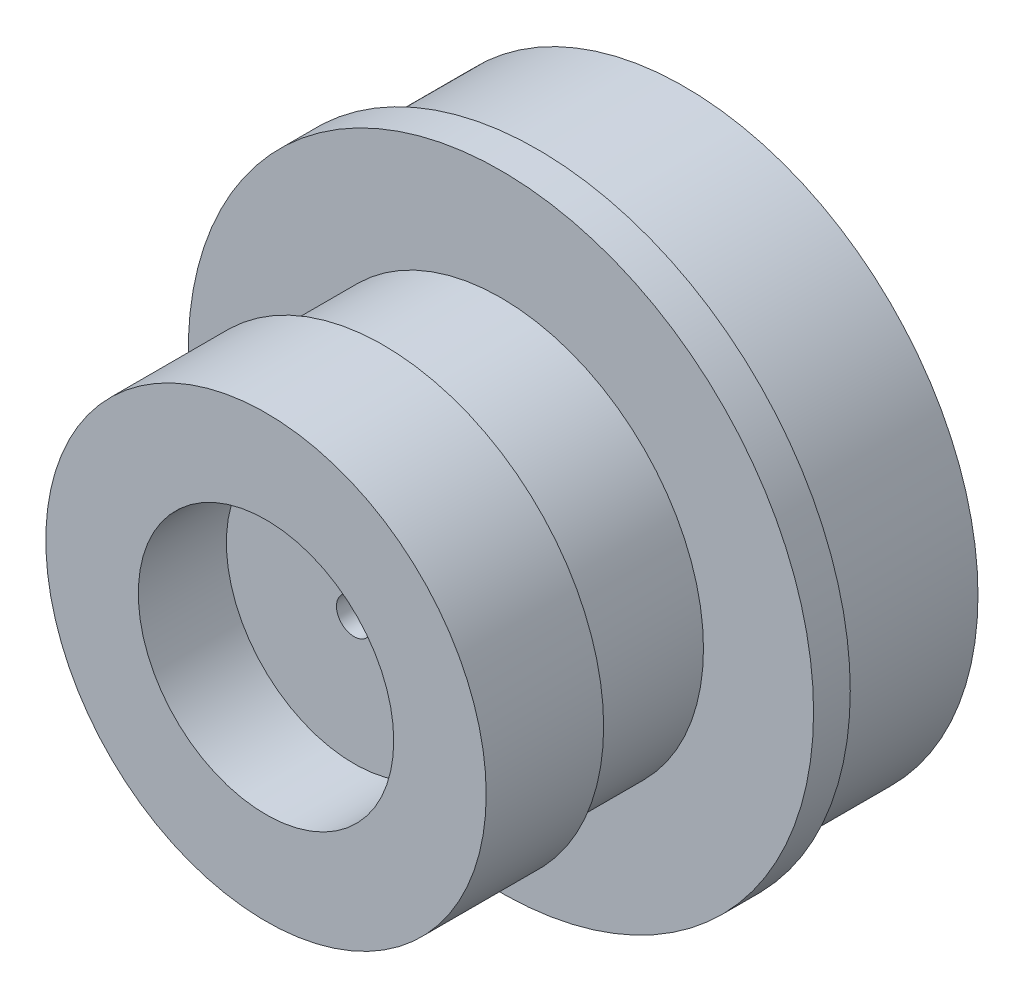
ISO-10303-21;
HEADER;
FILE_DESCRIPTION(('STEP AP214'),'2;1');
FILE_NAME('part.step','',(''),(''),'','','');
FILE_SCHEMA(('AUTOMOTIVE_DESIGN { 1 0 10303 214 1 1 1 1 }'));
ENDSEC;
DATA;
#1=APPLICATION_CONTEXT('core data for automotive mechanical design processes');
#2=APPLICATION_PROTOCOL_DEFINITION('international standard','automotive_design',2000,#1);
#3=PRODUCT_CONTEXT('',#1,'mechanical');
#4=PRODUCT('Part','Part','',(#3));
#5=PRODUCT_RELATED_PRODUCT_CATEGORY('part','',(#4));
#6=PRODUCT_DEFINITION_FORMATION('','',#4);
#7=PRODUCT_DEFINITION_CONTEXT('part definition',#1,'design');
#8=PRODUCT_DEFINITION('design','',#6,#7);
#9=PRODUCT_DEFINITION_SHAPE('','',#8);
#10=(LENGTH_UNIT() NAMED_UNIT(*) SI_UNIT(.MILLI.,.METRE.));
#11=(NAMED_UNIT(*) PLANE_ANGLE_UNIT() SI_UNIT($,.RADIAN.));
#12=(NAMED_UNIT(*) SI_UNIT($,.STERADIAN.) SOLID_ANGLE_UNIT());
#13=UNCERTAINTY_MEASURE_WITH_UNIT(LENGTH_MEASURE(1.E-05),#10,'distance_accuracy_value','');
#14=(GEOMETRIC_REPRESENTATION_CONTEXT(3) GLOBAL_UNCERTAINTY_ASSIGNED_CONTEXT((#13)) GLOBAL_UNIT_ASSIGNED_CONTEXT((#10,
#11,#12)) REPRESENTATION_CONTEXT('',''));
#15=CARTESIAN_POINT('',(0.,0.,0.));
#16=DIRECTION('',(0.,0.,1.));
#17=DIRECTION('',(1.,0.,0.));
#18=AXIS2_PLACEMENT_3D('',#15,#16,#17);
#19=CARTESIAN_POINT('',(0.,0.,0.));
#20=DIRECTION('',(0.,0.,1.));
#21=DIRECTION('',(1.,0.,0.));
#22=AXIS2_PLACEMENT_3D('',#19,#20,#21);
#23=CYLINDRICAL_SURFACE('',#22,1.524);
#24=CARTESIAN_POINT('',(0.,0.,28.575));
#25=DIRECTION('',(0.,0.,1.));
#26=DIRECTION('',(1.,0.,0.));
#27=AXIS2_PLACEMENT_3D('',#24,#25,#26);
#28=CIRCLE('',#27,1.524);
#29=CARTESIAN_POINT('',(1.524,0.,28.575));
#30=VERTEX_POINT('',#29);
#31=EDGE_CURVE('E66',#30,#30,#28,.T.);
#32=ORIENTED_EDGE('',*,*,#31,.T.);
#33=EDGE_LOOP('',(#32));
#34=FACE_BOUND('',#33,.T.);
#35=CARTESIAN_POINT('',(0.,0.,25.4));
#36=DIRECTION('',(0.,0.,-1.));
#37=DIRECTION('',(-1.,0.,0.));
#38=AXIS2_PLACEMENT_3D('',#35,#36,#37);
#39=CIRCLE('',#38,1.524);
#40=CARTESIAN_POINT('',(-1.524,0.,25.4));
#41=VERTEX_POINT('',#40);
#42=EDGE_CURVE('E32',#41,#41,#39,.F.);
#43=ORIENTED_EDGE('',*,*,#42,.F.);
#44=EDGE_LOOP('',(#43));
#45=FACE_BOUND('',#44,.T.);
#46=ADVANCED_FACE('F28',(#34,#45),#23,.F.);
#47=CARTESIAN_POINT('',(0.,0.,15.875));
#48=DIRECTION('',(0.,0.,1.));
#49=DIRECTION('',(1.,0.,0.));
#50=AXIS2_PLACEMENT_3D('',#47,#48,#49);
#51=PLANE('',#50);
#52=CARTESIAN_POINT('',(0.,0.,15.875));
#53=DIRECTION('',(0.,0.,1.));
#54=DIRECTION('',(1.,0.,0.));
#55=AXIS2_PLACEMENT_3D('',#52,#53,#54);
#56=CIRCLE('',#55,27.051);
#57=CARTESIAN_POINT('',(27.051,0.,15.875));
#58=VERTEX_POINT('',#57);
#59=EDGE_CURVE('E40',#58,#58,#56,.T.);
#60=ORIENTED_EDGE('',*,*,#59,.T.);
#61=EDGE_LOOP('',(#60));
#62=FACE_BOUND('',#61,.T.);
#63=CARTESIAN_POINT('',(0.,0.,15.875));
#64=DIRECTION('',(0.,0.,1.));
#65=DIRECTION('',(1.,0.,0.));
#66=AXIS2_PLACEMENT_3D('',#63,#64,#65);
#67=CIRCLE('',#66,17.526);
#68=CARTESIAN_POINT('',(17.526,0.,15.875));
#69=VERTEX_POINT('',#68);
#70=EDGE_CURVE('E51',#69,#69,#67,.T.);
#71=ORIENTED_EDGE('',*,*,#70,.F.);
#72=EDGE_LOOP('',(#71));
#73=FACE_BOUND('',#72,.T.);
#74=ADVANCED_FACE('F85',(#62,#73),#51,.T.);
#75=CARTESIAN_POINT('',(0.,0.,12.7));
#76=DIRECTION('',(0.,0.,-1.));
#77=DIRECTION('',(-1.,0.,0.));
#78=AXIS2_PLACEMENT_3D('',#75,#76,#77);
#79=CYLINDRICAL_SURFACE('',#78,25.4);
#80=CARTESIAN_POINT('',(0.,0.,12.7));
#81=DIRECTION('',(0.,0.,1.));
#82=DIRECTION('',(1.,0.,0.));
#83=AXIS2_PLACEMENT_3D('',#80,#81,#82);
#84=CIRCLE('',#83,25.4);
#85=CARTESIAN_POINT('',(25.4,0.,12.7));
#86=VERTEX_POINT('',#85);
#87=EDGE_CURVE('E10',#86,#86,#84,.T.);
#88=ORIENTED_EDGE('',*,*,#87,.F.);
#89=EDGE_LOOP('',(#88));
#90=FACE_BOUND('',#89,.T.);
#91=CARTESIAN_POINT('',(0.,0.,0.));
#92=DIRECTION('',(0.,0.,1.));
#93=DIRECTION('',(1.,0.,0.));
#94=AXIS2_PLACEMENT_3D('',#91,#92,#93);
#95=CIRCLE('',#94,25.4);
#96=CARTESIAN_POINT('',(25.4,0.,0.));
#97=VERTEX_POINT('',#96);
#98=EDGE_CURVE('E36',#97,#97,#95,.T.);
#99=ORIENTED_EDGE('',*,*,#98,.T.);
#100=EDGE_LOOP('',(#99));
#101=FACE_BOUND('',#100,.T.);
#102=ADVANCED_FACE('F30',(#90,#101),#79,.T.);
#103=CARTESIAN_POINT('',(0.,0.,0.));
#104=DIRECTION('',(0.,0.,1.));
#105=DIRECTION('',(1.,0.,0.));
#106=AXIS2_PLACEMENT_3D('',#103,#104,#105);
#107=PLANE('',#106);
#108=CARTESIAN_POINT('',(0.,0.,0.));
#109=DIRECTION('',(0.,0.,-1.));
#110=DIRECTION('',(-1.,0.,0.));
#111=AXIS2_PLACEMENT_3D('',#108,#109,#110);
#112=CIRCLE('',#111,14.351);
#113=CARTESIAN_POINT('',(-14.351,0.,0.));
#114=VERTEX_POINT('',#113);
#115=EDGE_CURVE('E72',#114,#114,#112,.T.);
#116=ORIENTED_EDGE('',*,*,#115,.F.);
#117=EDGE_LOOP('',(#116));
#118=FACE_BOUND('',#117,.T.);
#119=ORIENTED_EDGE('',*,*,#98,.F.);
#120=EDGE_LOOP('',(#119));
#121=FACE_BOUND('',#120,.T.);
#122=ADVANCED_FACE('F78',(#118,#121),#107,.F.);
#123=CARTESIAN_POINT('',(0.,0.,12.7));
#124=DIRECTION('',(0.,0.,1.));
#125=DIRECTION('',(1.,0.,0.));
#126=AXIS2_PLACEMENT_3D('',#123,#124,#125);
#127=PLANE('',#126);
#128=CARTESIAN_POINT('',(0.,0.,12.7));
#129=DIRECTION('',(0.,0.,1.));
#130=DIRECTION('',(1.,0.,0.));
#131=AXIS2_PLACEMENT_3D('',#128,#129,#130);
#132=CIRCLE('',#131,27.051);
#133=CARTESIAN_POINT('',(27.051,0.,12.7));
#134=VERTEX_POINT('',#133);
#135=EDGE_CURVE('E45',#134,#134,#132,.T.);
#136=ORIENTED_EDGE('',*,*,#135,.F.);
#137=EDGE_LOOP('',(#136));
#138=FACE_BOUND('',#137,.T.);
#139=ORIENTED_EDGE('',*,*,#87,.T.);
#140=EDGE_LOOP('',(#139));
#141=FACE_BOUND('',#140,.T.);
#142=ADVANCED_FACE('F81',(#138,#141),#127,.F.);
#143=CARTESIAN_POINT('',(0.,0.,15.875));
#144=DIRECTION('',(0.,0.,-1.));
#145=DIRECTION('',(-1.,0.,0.));
#146=AXIS2_PLACEMENT_3D('',#143,#144,#145);
#147=CYLINDRICAL_SURFACE('',#146,27.051);
#148=ORIENTED_EDGE('',*,*,#59,.F.);
#149=EDGE_LOOP('',(#148));
#150=FACE_BOUND('',#149,.T.);
#151=ORIENTED_EDGE('',*,*,#135,.T.);
#152=EDGE_LOOP('',(#151));
#153=FACE_BOUND('',#152,.T.);
#154=ADVANCED_FACE('F125',(#150,#153),#147,.T.);
#155=CARTESIAN_POINT('',(0.,0.,26.035));
#156=DIRECTION('',(0.,0.,-1.));
#157=DIRECTION('',(-1.,0.,0.));
#158=AXIS2_PLACEMENT_3D('',#155,#156,#157);
#159=CYLINDRICAL_SURFACE('',#158,17.526);
#160=CARTESIAN_POINT('',(0.,0.,26.035));
#161=DIRECTION('',(0.,0.,1.));
#162=DIRECTION('',(1.,0.,0.));
#163=AXIS2_PLACEMENT_3D('',#160,#161,#162);
#164=CIRCLE('',#163,17.526);
#165=CARTESIAN_POINT('',(17.526,0.,26.035));
#166=VERTEX_POINT('',#165);
#167=EDGE_CURVE('E48',#166,#166,#164,.T.);
#168=ORIENTED_EDGE('',*,*,#167,.F.);
#169=EDGE_LOOP('',(#168));
#170=FACE_BOUND('',#169,.T.);
#171=ORIENTED_EDGE('',*,*,#70,.T.);
#172=EDGE_LOOP('',(#171));
#173=FACE_BOUND('',#172,.T.);
#174=ADVANCED_FACE('F115',(#170,#173),#159,.T.);
#175=CARTESIAN_POINT('',(0.,0.,26.035));
#176=DIRECTION('',(0.,0.,1.));
#177=DIRECTION('',(1.,0.,0.));
#178=AXIS2_PLACEMENT_3D('',#175,#176,#177);
#179=PLANE('',#178);
#180=CARTESIAN_POINT('',(0.,0.,26.035));
#181=DIRECTION('',(0.,0.,1.));
#182=DIRECTION('',(1.,0.,0.));
#183=AXIS2_PLACEMENT_3D('',#180,#181,#182);
#184=CIRCLE('',#183,19.05);
#185=CARTESIAN_POINT('',(19.05,0.,26.035));
#186=VERTEX_POINT('',#185);
#187=EDGE_CURVE('E57',#186,#186,#184,.T.);
#188=ORIENTED_EDGE('',*,*,#187,.F.);
#189=EDGE_LOOP('',(#188));
#190=FACE_BOUND('',#189,.T.);
#191=ORIENTED_EDGE('',*,*,#167,.T.);
#192=EDGE_LOOP('',(#191));
#193=FACE_BOUND('',#192,.T.);
#194=ADVANCED_FACE('F111',(#190,#193),#179,.F.);
#195=CARTESIAN_POINT('',(0.,0.,36.195));
#196=DIRECTION('',(0.,0.,-1.));
#197=DIRECTION('',(-1.,0.,0.));
#198=AXIS2_PLACEMENT_3D('',#195,#196,#197);
#199=CYLINDRICAL_SURFACE('',#198,19.05);
#200=CARTESIAN_POINT('',(0.,0.,36.195));
#201=DIRECTION('',(0.,0.,1.));
#202=DIRECTION('',(1.,0.,0.));
#203=AXIS2_PLACEMENT_3D('',#200,#201,#202);
#204=CIRCLE('',#203,19.05);
#205=CARTESIAN_POINT('',(19.05,0.,36.195));
#206=VERTEX_POINT('',#205);
#207=EDGE_CURVE('E54',#206,#206,#204,.T.);
#208=ORIENTED_EDGE('',*,*,#207,.F.);
#209=EDGE_LOOP('',(#208));
#210=FACE_BOUND('',#209,.T.);
#211=ORIENTED_EDGE('',*,*,#187,.T.);
#212=EDGE_LOOP('',(#211));
#213=FACE_BOUND('',#212,.T.);
#214=ADVANCED_FACE('F114',(#210,#213),#199,.T.);
#215=CARTESIAN_POINT('',(0.,0.,36.195));
#216=DIRECTION('',(0.,0.,1.));
#217=DIRECTION('',(1.,0.,0.));
#218=AXIS2_PLACEMENT_3D('',#215,#216,#217);
#219=PLANE('',#218);
#220=CARTESIAN_POINT('',(0.,0.,36.195));
#221=DIRECTION('',(0.,0.,1.));
#222=DIRECTION('',(1.,0.,0.));
#223=AXIS2_PLACEMENT_3D('',#220,#221,#222);
#224=CIRCLE('',#223,11.049);
#225=CARTESIAN_POINT('',(11.049,0.,36.195));
#226=VERTEX_POINT('',#225);
#227=EDGE_CURVE('E63',#226,#226,#224,.T.);
#228=ORIENTED_EDGE('',*,*,#227,.F.);
#229=EDGE_LOOP('',(#228));
#230=FACE_BOUND('',#229,.T.);
#231=ORIENTED_EDGE('',*,*,#207,.T.);
#232=EDGE_LOOP('',(#231));
#233=FACE_BOUND('',#232,.T.);
#234=ADVANCED_FACE('F109',(#230,#233),#219,.T.);
#235=CARTESIAN_POINT('',(0.,0.,28.575));
#236=DIRECTION('',(0.,0.,1.));
#237=DIRECTION('',(1.,0.,0.));
#238=AXIS2_PLACEMENT_3D('',#235,#236,#237);
#239=CYLINDRICAL_SURFACE('',#238,11.049);
#240=CARTESIAN_POINT('',(0.,0.,28.575));
#241=DIRECTION('',(0.,0.,1.));
#242=DIRECTION('',(1.,0.,0.));
#243=AXIS2_PLACEMENT_3D('',#240,#241,#242);
#244=CIRCLE('',#243,11.049);
#245=CARTESIAN_POINT('',(11.049,0.,28.575));
#246=VERTEX_POINT('',#245);
#247=EDGE_CURVE('E60',#246,#246,#244,.T.);
#248=CARTESIAN_POINT('',(11.049,0.,28.575));
#249=CARTESIAN_POINT('',(11.049,0.,28.654375));
#250=CARTESIAN_POINT('',(11.049,0.,28.73375));
#251=CARTESIAN_POINT('',(11.049,0.,28.8925));
#252=CARTESIAN_POINT('',(11.049,0.,28.971875));
#253=CARTESIAN_POINT('',(11.049,0.,29.130625));
#254=CARTESIAN_POINT('',(11.049,0.,29.21));
#255=CARTESIAN_POINT('',(11.049,0.,29.36875));
#256=CARTESIAN_POINT('',(11.049,0.,29.448125));
#257=CARTESIAN_POINT('',(11.049,0.,29.606875));
#258=CARTESIAN_POINT('',(11.049,0.,29.68625));
#259=CARTESIAN_POINT('',(11.049,0.,29.845));
#260=CARTESIAN_POINT('',(11.049,0.,29.924375));
#261=CARTESIAN_POINT('',(11.049,0.,30.083125));
#262=CARTESIAN_POINT('',(11.049,0.,30.1625));
#263=CARTESIAN_POINT('',(11.049,0.,30.32125));
#264=CARTESIAN_POINT('',(11.049,0.,30.400625));
#265=CARTESIAN_POINT('',(11.049,0.,30.559375));
#266=CARTESIAN_POINT('',(11.049,0.,30.63875));
#267=CARTESIAN_POINT('',(11.049,0.,30.7975));
#268=CARTESIAN_POINT('',(11.049,0.,30.876875));
#269=CARTESIAN_POINT('',(11.049,0.,31.035625));
#270=CARTESIAN_POINT('',(11.049,0.,31.115));
#271=CARTESIAN_POINT('',(11.049,0.,31.27375));
#272=CARTESIAN_POINT('',(11.049,0.,31.353125));
#273=CARTESIAN_POINT('',(11.049,0.,31.511875));
#274=CARTESIAN_POINT('',(11.049,0.,31.59125));
#275=CARTESIAN_POINT('',(11.049,0.,31.75));
#276=CARTESIAN_POINT('',(11.049,0.,31.829375));
#277=CARTESIAN_POINT('',(11.049,0.,31.988125));
#278=CARTESIAN_POINT('',(11.049,0.,32.0675));
#279=CARTESIAN_POINT('',(11.049,0.,32.22625));
#280=CARTESIAN_POINT('',(11.049,0.,32.305625));
#281=CARTESIAN_POINT('',(11.049,0.,32.464375));
#282=CARTESIAN_POINT('',(11.049,0.,32.54375));
#283=CARTESIAN_POINT('',(11.049,0.,32.7025));
#284=CARTESIAN_POINT('',(11.049,0.,32.781875));
#285=CARTESIAN_POINT('',(11.049,0.,32.940625));
#286=CARTESIAN_POINT('',(11.049,0.,33.02));
#287=CARTESIAN_POINT('',(11.049,0.,33.17875));
#288=CARTESIAN_POINT('',(11.049,0.,33.258125));
#289=CARTESIAN_POINT('',(11.049,0.,33.416875));
#290=CARTESIAN_POINT('',(11.049,0.,33.49625));
#291=CARTESIAN_POINT('',(11.049,0.,33.655));
#292=CARTESIAN_POINT('',(11.049,0.,33.734375));
#293=CARTESIAN_POINT('',(11.049,0.,33.893125));
#294=CARTESIAN_POINT('',(11.049,0.,33.9725));
#295=CARTESIAN_POINT('',(11.049,0.,34.13125));
#296=CARTESIAN_POINT('',(11.049,0.,34.210625));
#297=CARTESIAN_POINT('',(11.049,0.,34.369375));
#298=CARTESIAN_POINT('',(11.049,0.,34.44875));
#299=CARTESIAN_POINT('',(11.049,0.,34.6075));
#300=CARTESIAN_POINT('',(11.049,0.,34.686875));
#301=CARTESIAN_POINT('',(11.049,0.,34.845625));
#302=CARTESIAN_POINT('',(11.049,0.,34.925));
#303=CARTESIAN_POINT('',(11.049,0.,35.08375));
#304=CARTESIAN_POINT('',(11.049,0.,35.163125));
#305=CARTESIAN_POINT('',(11.049,0.,35.321875));
#306=CARTESIAN_POINT('',(11.049,0.,35.40125));
#307=CARTESIAN_POINT('',(11.049,0.,35.56));
#308=CARTESIAN_POINT('',(11.049,0.,35.639375));
#309=CARTESIAN_POINT('',(11.049,0.,35.798125));
#310=CARTESIAN_POINT('',(11.049,0.,35.8775));
#311=CARTESIAN_POINT('',(11.049,0.,36.03625));
#312=CARTESIAN_POINT('',(11.049,0.,36.115625));
#313=CARTESIAN_POINT('',(11.049,0.,36.195));
#314=B_SPLINE_CURVE_WITH_KNOTS('',3,(#248,#249,#250,#251,#252,#253,#254,#255,#256,#257,#258,
#259,#260,#261,#262,#263,#264,#265,#266,#267,#268,#269,#270,#271,#272,#273,#274,#275,#276,#277,
#278,#279,#280,#281,#282,#283,#284,#285,#286,#287,#288,#289,#290,#291,#292,#293,#294,#295,#296,
#297,#298,#299,#300,#301,#302,#303,#304,#305,#306,#307,#308,#309,#310,#311,#312,#313),
.UNSPECIFIED.,.F.,.F.,(4,2,2,2,2,2,2,2,2,2,2,2,2,2,2,2,2,2,2,2,2,2,2,2,2,2,2,2,2,2,2,2,4),(0.,
0.238125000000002,0.476250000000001,0.714375,0.952500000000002,1.190625,1.42875,1.666875,1.905,
2.143125,2.38125,2.619375,2.8575,3.095625,3.33375,3.571875,3.81,4.048125,4.28625,4.524375,
4.7625,5.000625,5.23875,5.476875,5.715,5.953125,6.19125,6.429375,6.6675,6.905625,7.14375,
7.381875,7.61999999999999),.UNSPECIFIED.);
#315=EDGE_CURVE('BSEAM105',#246,#226,#314,.T.);
#316=ORIENTED_EDGE('',*,*,#247,.F.);
#317=ORIENTED_EDGE('',*,*,#227,.T.);
#318=ORIENTED_EDGE('',*,*,#315,.T.);
#319=ORIENTED_EDGE('',*,*,#315,.F.);
#320=EDGE_LOOP('',(#316,#318,#317,#319));
#321=FACE_BOUND('',#320,.T.);
#322=ADVANCED_FACE('F105',(#321),#239,.F.);
#323=CARTESIAN_POINT('',(0.,0.,28.575));
#324=DIRECTION('',(0.,0.,1.));
#325=DIRECTION('',(1.,0.,0.));
#326=AXIS2_PLACEMENT_3D('',#323,#324,#325);
#327=PLANE('',#326);
#328=ORIENTED_EDGE('',*,*,#31,.F.);
#329=EDGE_LOOP('',(#328));
#330=FACE_BOUND('',#329,.T.);
#331=ORIENTED_EDGE('',*,*,#247,.T.);
#332=EDGE_LOOP('',(#331));
#333=FACE_BOUND('',#332,.T.);
#334=ADVANCED_FACE('F101',(#330,#333),#327,.T.);
#335=CARTESIAN_POINT('',(0.,0.,25.4));
#336=DIRECTION('',(0.,0.,-1.));
#337=DIRECTION('',(-1.,0.,0.));
#338=AXIS2_PLACEMENT_3D('',#335,#336,#337);
#339=PLANE('',#338);
#340=CARTESIAN_POINT('',(0.,0.,25.4));
#341=DIRECTION('',(0.,0.,-1.));
#342=DIRECTION('',(-1.,0.,0.));
#343=AXIS2_PLACEMENT_3D('',#340,#341,#342);
#344=CIRCLE('',#343,14.351);
#345=CARTESIAN_POINT('',(-14.351,0.,25.4));
#346=VERTEX_POINT('',#345);
#347=EDGE_CURVE('E69',#346,#346,#344,.T.);
#348=ORIENTED_EDGE('',*,*,#347,.T.);
#349=EDGE_LOOP('',(#348));
#350=FACE_BOUND('',#349,.T.);
#351=ORIENTED_EDGE('',*,*,#42,.T.);
#352=EDGE_LOOP('',(#351));
#353=FACE_BOUND('',#352,.T.);
#354=ADVANCED_FACE('F104',(#350,#353),#339,.T.);
#355=CARTESIAN_POINT('',(0.,0.,25.4));
#356=DIRECTION('',(0.,0.,-1.));
#357=DIRECTION('',(-1.,0.,0.));
#358=AXIS2_PLACEMENT_3D('',#355,#356,#357);
#359=CYLINDRICAL_SURFACE('',#358,14.351);
#360=ORIENTED_EDGE('',*,*,#347,.F.);
#361=EDGE_LOOP('',(#360));
#362=FACE_BOUND('',#361,.T.);
#363=ORIENTED_EDGE('',*,*,#115,.T.);
#364=EDGE_LOOP('',(#363));
#365=FACE_BOUND('',#364,.T.);
#366=ADVANCED_FACE('F76',(#362,#365),#359,.F.);
#367=CLOSED_SHELL('',(#46,#74,#102,#122,#142,#154,#174,#194,#214,#234,#322,#334,#354,#366));
#368=MANIFOLD_SOLID_BREP('B2',#367);
#369=ADVANCED_BREP_SHAPE_REPRESENTATION('',(#18,#368),#14);
#370=SHAPE_DEFINITION_REPRESENTATION(#9,#369);
ENDSEC;
END-ISO-10303-21;
